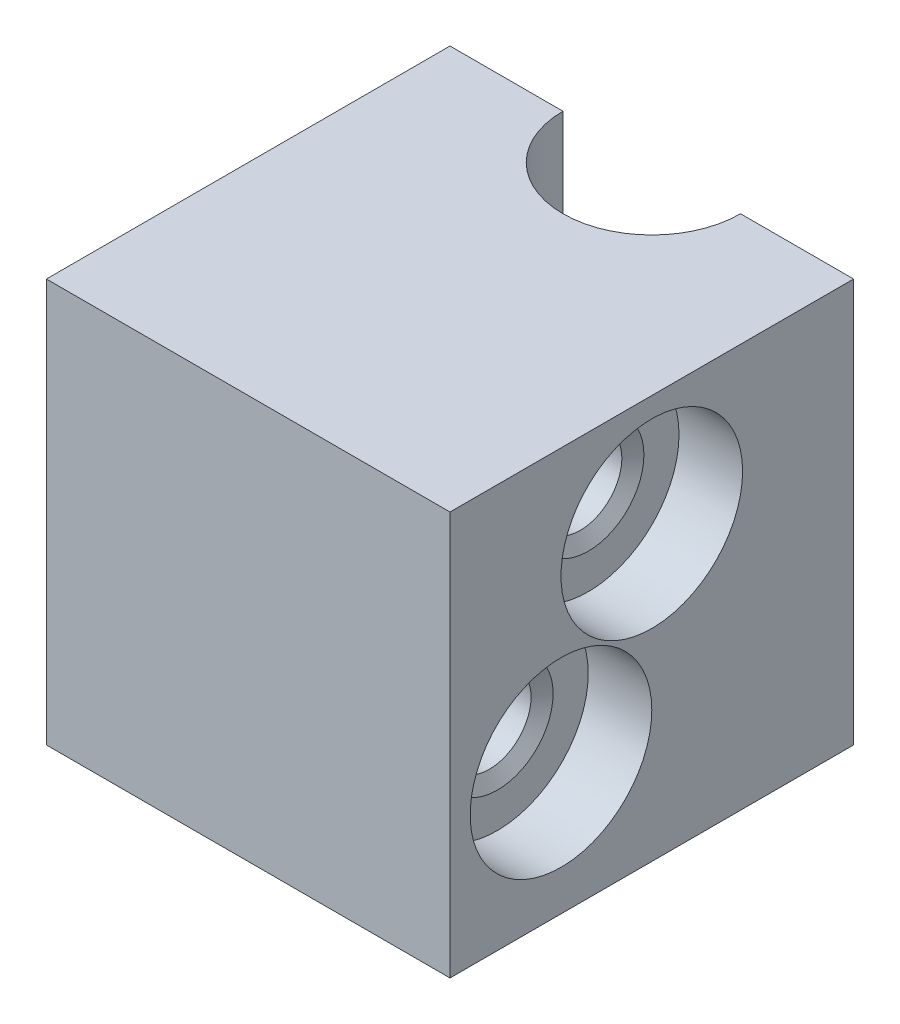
ISO-10303-21;
HEADER;
FILE_DESCRIPTION(('STEP AP214'),'2;1');
FILE_NAME('part.step','',(''),(''),'','','');
FILE_SCHEMA(('AUTOMOTIVE_DESIGN { 1 0 10303 214 1 1 1 1 }'));
ENDSEC;
DATA;
#1=APPLICATION_CONTEXT('core data for automotive mechanical design processes');
#2=APPLICATION_PROTOCOL_DEFINITION('international standard','automotive_design',2000,#1);
#3=PRODUCT_CONTEXT('',#1,'mechanical');
#4=PRODUCT('Part','Part','',(#3));
#5=PRODUCT_RELATED_PRODUCT_CATEGORY('part','',(#4));
#6=PRODUCT_DEFINITION_FORMATION('','',#4);
#7=PRODUCT_DEFINITION_CONTEXT('part definition',#1,'design');
#8=PRODUCT_DEFINITION('design','',#6,#7);
#9=PRODUCT_DEFINITION_SHAPE('','',#8);
#10=(LENGTH_UNIT() NAMED_UNIT(*) SI_UNIT(.MILLI.,.METRE.));
#11=(NAMED_UNIT(*) PLANE_ANGLE_UNIT() SI_UNIT($,.RADIAN.));
#12=(NAMED_UNIT(*) SI_UNIT($,.STERADIAN.) SOLID_ANGLE_UNIT());
#13=UNCERTAINTY_MEASURE_WITH_UNIT(LENGTH_MEASURE(1.E-05),#10,'distance_accuracy_value','');
#14=(GEOMETRIC_REPRESENTATION_CONTEXT(3) GLOBAL_UNCERTAINTY_ASSIGNED_CONTEXT((#13)) GLOBAL_UNIT_ASSIGNED_CONTEXT((#10,
#11,#12)) REPRESENTATION_CONTEXT('',''));
#15=CARTESIAN_POINT('',(0.,0.,0.));
#16=DIRECTION('',(0.,0.,1.));
#17=DIRECTION('',(1.,0.,0.));
#18=AXIS2_PLACEMENT_3D('',#15,#16,#17);
#19=CARTESIAN_POINT('',(50.8,36.83,25.4));
#20=DIRECTION('',(1.,0.,0.));
#21=DIRECTION('',(0.,0.,-1.));
#22=AXIS2_PLACEMENT_3D('',#19,#20,#21);
#23=CYLINDRICAL_SURFACE('',#22,5.24999999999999);
#24=CARTESIAN_POINT('',(9.017,36.83,25.4));
#25=DIRECTION('',(-1.,0.,0.));
#26=DIRECTION('',(0.,0.,1.));
#27=AXIS2_PLACEMENT_3D('',#24,#25,#26);
#28=CIRCLE('',#27,5.24999999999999);
#29=CARTESIAN_POINT('',(9.017,36.83,30.65));
#30=VERTEX_POINT('',#29);
#31=EDGE_CURVE('E167',#30,#30,#28,.T.);
#32=ORIENTED_EDGE('',*,*,#31,.T.);
#33=EDGE_LOOP('',(#32));
#34=FACE_BOUND('',#33,.T.);
#35=CARTESIAN_POINT('',(41.783,36.83,25.4));
#36=DIRECTION('',(1.,0.,0.));
#37=DIRECTION('',(0.,0.,-1.));
#38=AXIS2_PLACEMENT_3D('',#35,#36,#37);
#39=CIRCLE('',#38,5.24999999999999);
#40=CARTESIAN_POINT('',(41.783,36.83,20.15));
#41=VERTEX_POINT('',#40);
#42=EDGE_CURVE('E164',#41,#41,#39,.T.);
#43=ORIENTED_EDGE('',*,*,#42,.T.);
#44=EDGE_LOOP('',(#43));
#45=FACE_BOUND('',#44,.T.);
#46=CARTESIAN_POINT('',(25.4,31.6558161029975,24.511));
#47=CARTESIAN_POINT('',(25.4495499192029,31.655815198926,24.5110019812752));
#48=CARTESIAN_POINT('',(25.4991266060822,31.6550966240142,24.5151566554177));
#49=CARTESIAN_POINT('',(25.5968881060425,31.6523027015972,24.5316578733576));
#50=CARTESIAN_POINT('',(25.6450716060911,31.6502261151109,24.5440118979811));
#51=CARTESIAN_POINT('',(25.7386177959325,31.6449579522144,24.5765266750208));
#52=CARTESIAN_POINT('',(25.7839828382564,31.6417673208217,24.5966808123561));
#53=CARTESIAN_POINT('',(25.8706828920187,31.634631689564,24.6442071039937));
#54=CARTESIAN_POINT('',(25.9120183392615,31.6306867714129,24.6715784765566));
#55=CARTESIAN_POINT('',(25.9899109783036,31.6224422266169,24.7330592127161));
#56=CARTESIAN_POINT('',(26.026421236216,31.6181396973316,24.7672276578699));
#57=CARTESIAN_POINT('',(26.0932192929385,31.6096904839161,24.8412049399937));
#58=CARTESIAN_POINT('',(26.1235067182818,31.6055438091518,24.8810141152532));
#59=CARTESIAN_POINT('',(26.1771759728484,31.5978427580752,24.9654474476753));
#60=CARTESIAN_POINT('',(26.2005140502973,31.5942921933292,25.0100997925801));
#61=CARTESIAN_POINT('',(26.2393408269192,31.5882157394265,25.1027612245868));
#62=CARTESIAN_POINT('',(26.2548300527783,31.5856897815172,25.1507700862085));
#63=CARTESIAN_POINT('',(26.2773756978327,31.5819676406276,25.2482966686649));
#64=CARTESIAN_POINT('',(26.2845110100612,31.5807590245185,25.2977956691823));
#65=CARTESIAN_POINT('',(26.290391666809,31.579765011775,25.3973020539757));
#66=CARTESIAN_POINT('',(26.2891375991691,31.5799795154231,25.4473094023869));
#67=CARTESIAN_POINT('',(26.2783364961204,31.5817977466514,25.5458733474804));
#68=CARTESIAN_POINT('',(26.2688743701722,31.5833872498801,25.5944395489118));
#69=CARTESIAN_POINT('',(26.2420595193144,31.5877610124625,25.6892847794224));
#70=CARTESIAN_POINT('',(26.2247065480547,31.5905453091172,25.7355637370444));
#71=CARTESIAN_POINT('',(26.1825186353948,31.5970199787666,25.8247725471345));
#72=CARTESIAN_POINT('',(26.1576488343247,31.6007145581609,25.8676855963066));
#73=CARTESIAN_POINT('',(26.1011587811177,31.6085995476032,25.9487613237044));
#74=CARTESIAN_POINT('',(26.0695379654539,31.6127899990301,25.9869236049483));
#75=CARTESIAN_POINT('',(25.9999729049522,31.6212628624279,26.057916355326));
#76=CARTESIAN_POINT('',(25.9619544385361,31.6255457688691,26.0906740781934));
#77=CARTESIAN_POINT('',(25.8809230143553,31.6336701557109,26.1493573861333));
#78=CARTESIAN_POINT('',(25.8379100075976,31.6375116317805,26.1752829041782));
#79=CARTESIAN_POINT('',(25.7480246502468,31.6443185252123,26.2195809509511));
#80=CARTESIAN_POINT('',(25.7011477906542,31.6472828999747,26.2379445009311));
#81=CARTESIAN_POINT('',(25.6049132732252,31.6519828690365,26.2665161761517));
#82=CARTESIAN_POINT('',(25.5555558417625,31.6537185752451,26.2767250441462));
#83=CARTESIAN_POINT('',(25.4564127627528,31.6557429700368,26.2885946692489));
#84=CARTESIAN_POINT('',(25.4066398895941,31.6560492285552,26.2903592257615));
#85=CARTESIAN_POINT('',(25.3075100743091,31.6552268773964,26.2855669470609));
#86=CARTESIAN_POINT('',(25.2581531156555,31.6540983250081,26.2790104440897));
#87=CARTESIAN_POINT('',(25.1615873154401,31.6505497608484,26.2578507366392));
#88=CARTESIAN_POINT('',(25.1143665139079,31.6481382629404,26.2433005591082));
#89=CARTESIAN_POINT('',(25.023033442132,31.6423026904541,26.2066222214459));
#90=CARTESIAN_POINT('',(24.9789213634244,31.638878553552,26.1844935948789));
#91=CARTESIAN_POINT('',(24.8945965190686,31.6313627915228,26.1330422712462));
#92=CARTESIAN_POINT('',(24.8544248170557,31.6272651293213,26.1036531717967));
#93=CARTESIAN_POINT('',(24.7795459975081,31.618881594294,26.0386060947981));
#94=CARTESIAN_POINT('',(24.7448392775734,31.614595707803,26.0029476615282));
#95=CARTESIAN_POINT('',(24.6814955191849,31.6062629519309,25.9259137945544));
#96=CARTESIAN_POINT('',(24.6529277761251,31.6022191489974,25.8844809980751));
#97=CARTESIAN_POINT('',(24.6031587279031,31.594875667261,25.7973438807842));
#98=CARTESIAN_POINT('',(24.581957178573,31.5915759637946,25.7516397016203));
#99=CARTESIAN_POINT('',(24.5476296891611,31.5861057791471,25.6574612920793));
#100=CARTESIAN_POINT('',(24.5344677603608,31.5839302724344,25.6090004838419));
#101=CARTESIAN_POINT('',(24.5164773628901,31.5809323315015,25.5105163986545));
#102=CARTESIAN_POINT('',(24.5116481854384,31.5801097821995,25.4604932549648));
#103=CARTESIAN_POINT('',(24.5104812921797,31.5799121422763,25.3609727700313));
#104=CARTESIAN_POINT('',(24.5140382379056,31.5805190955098,25.3114766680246));
#105=CARTESIAN_POINT('',(24.5293144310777,31.5830755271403,25.2137977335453));
#106=CARTESIAN_POINT('',(24.5410336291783,31.5850249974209,25.1656148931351));
#107=CARTESIAN_POINT('',(24.5722607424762,31.5900481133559,25.0719723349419));
#108=CARTESIAN_POINT('',(24.5917594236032,31.5931204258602,25.0265094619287));
#109=CARTESIAN_POINT('',(24.6379801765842,31.6000541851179,24.9394843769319));
#110=CARTESIAN_POINT('',(24.6647026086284,31.6039156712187,24.8979223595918));
#111=CARTESIAN_POINT('',(24.7249844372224,31.6120573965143,24.8193488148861));
#112=CARTESIAN_POINT('',(24.7586208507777,31.6163420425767,24.7823968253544));
#113=CARTESIAN_POINT('',(24.8316143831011,31.6248170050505,24.7146245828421));
#114=CARTESIAN_POINT('',(24.870972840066,31.6290072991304,24.6838057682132));
#115=CARTESIAN_POINT('',(24.9546361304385,31.636852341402,24.6289665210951));
#116=CARTESIAN_POINT('',(24.9989751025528,31.6405029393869,24.604997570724));
#117=CARTESIAN_POINT('',(25.0910942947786,31.6468061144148,24.5648850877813));
#118=CARTESIAN_POINT('',(25.1388710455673,31.6494596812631,24.5487337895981));
#119=CARTESIAN_POINT('',(25.2223572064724,31.6528840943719,24.5281956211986));
#120=CARTESIAN_POINT('',(25.2575630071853,31.6539774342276,24.5217576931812));
#121=CARTESIAN_POINT('',(25.3285078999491,31.6554437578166,24.5131592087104));
#122=CARTESIAN_POINT('',(25.3642469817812,31.6558167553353,24.5109985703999));
#123=CARTESIAN_POINT('',(25.4,31.6558161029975,24.511));
#124=B_SPLINE_CURVE_WITH_KNOTS('',3,(#46,#47,#48,#49,#50,#51,#52,#53,#54,#55,#56,#57,#58,#59,
#60,#61,#62,#63,#64,#65,#66,#67,#68,#69,#70,#71,#72,#73,#74,#75,#76,#77,#78,#79,#80,#81,#82,#83,
#84,#85,#86,#87,#88,#89,#90,#91,#92,#93,#94,#95,#96,#97,#98,#99,#100,#101,#102,#103,#104,#105,
#106,#107,#108,#109,#110,#111,#112,#113,#114,#115,#116,#117,#118,#119,#120,#121,#122,#123),
.UNSPECIFIED.,.T.,.F.,(4,2,2,2,2,2,2,2,2,2,2,2,2,2,2,2,2,2,2,2,2,2,2,2,2,2,2,2,2,2,2,2,2,2,2,2,
2,2,4),(0.,0.148519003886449,0.297173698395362,0.445702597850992,0.594215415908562,
0.744080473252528,0.893954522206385,1.04475311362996,1.19554158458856,1.34489424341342,
1.49423643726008,1.6420519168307,1.78987201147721,1.9383884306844,2.08691725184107,
2.23730589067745,2.38769600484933,2.53826417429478,2.68881862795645,2.83751759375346,
2.9862106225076,3.13392898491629,3.28165644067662,3.43078852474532,3.57993145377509,
3.73067844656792,3.88142044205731,4.03148261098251,4.18153201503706,4.32970670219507,
4.47788049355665,4.62587892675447,4.77388474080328,4.92363849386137,5.07342732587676,
5.22431398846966,5.37505045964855,5.48221721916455,5.58938192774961),.UNSPECIFIED.);
#125=CARTESIAN_POINT('',(25.4,31.6558161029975,24.511));
#126=VERTEX_POINT('',#125);
#127=EDGE_CURVE('E285',#126,#126,#124,.T.);
#128=ORIENTED_EDGE('',*,*,#127,.T.);
#129=EDGE_LOOP('',(#128));
#130=FACE_BOUND('',#129,.T.);
#131=ADVANCED_FACE('F62',(#34,#45,#130),#23,.F.);
#132=CARTESIAN_POINT('',(50.8,16.51,36.83));
#133=DIRECTION('',(1.,0.,0.));
#134=DIRECTION('',(0.,0.,-1.));
#135=AXIS2_PLACEMENT_3D('',#132,#133,#134);
#136=CYLINDRICAL_SURFACE('',#135,5.24999999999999);
#137=CARTESIAN_POINT('',(9.017,16.51,36.83));
#138=DIRECTION('',(-1.,0.,0.));
#139=DIRECTION('',(0.,0.,1.));
#140=AXIS2_PLACEMENT_3D('',#137,#138,#139);
#141=CIRCLE('',#140,5.24999999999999);
#142=CARTESIAN_POINT('',(9.017,16.51,42.08));
#143=VERTEX_POINT('',#142);
#144=EDGE_CURVE('E176',#143,#143,#141,.T.);
#145=ORIENTED_EDGE('',*,*,#144,.T.);
#146=EDGE_LOOP('',(#145));
#147=FACE_BOUND('',#146,.T.);
#148=CARTESIAN_POINT('',(41.783,16.51,36.83));
#149=DIRECTION('',(1.,0.,0.));
#150=DIRECTION('',(0.,0.,-1.));
#151=AXIS2_PLACEMENT_3D('',#148,#149,#150);
#152=CIRCLE('',#151,5.24999999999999);
#153=CARTESIAN_POINT('',(41.783,16.51,31.58));
#154=VERTEX_POINT('',#153);
#155=EDGE_CURVE('E173',#154,#154,#152,.T.);
#156=ORIENTED_EDGE('',*,*,#155,.T.);
#157=EDGE_LOOP('',(#156));
#158=FACE_BOUND('',#157,.T.);
#159=CARTESIAN_POINT('',(25.4,11.3358161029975,35.941));
#160=CARTESIAN_POINT('',(25.4495499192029,11.335815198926,35.9410019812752));
#161=CARTESIAN_POINT('',(25.4991266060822,11.3350966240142,35.9451566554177));
#162=CARTESIAN_POINT('',(25.5968881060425,11.3323027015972,35.9616578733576));
#163=CARTESIAN_POINT('',(25.6450716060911,11.3302261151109,35.9740118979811));
#164=CARTESIAN_POINT('',(25.7386177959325,11.3249579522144,36.0065266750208));
#165=CARTESIAN_POINT('',(25.7839828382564,11.3217673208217,36.026680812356));
#166=CARTESIAN_POINT('',(25.8706828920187,11.314631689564,36.0742071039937));
#167=CARTESIAN_POINT('',(25.9120183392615,11.3106867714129,36.1015784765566));
#168=CARTESIAN_POINT('',(25.9899109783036,11.3024422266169,36.1630592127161));
#169=CARTESIAN_POINT('',(26.026421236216,11.2981396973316,36.1972276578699));
#170=CARTESIAN_POINT('',(26.0932192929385,11.2896904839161,36.2712049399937));
#171=CARTESIAN_POINT('',(26.1235067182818,11.2855438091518,36.3110141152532));
#172=CARTESIAN_POINT('',(26.1771759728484,11.2778427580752,36.3954474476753));
#173=CARTESIAN_POINT('',(26.2005140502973,11.2742921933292,36.44009979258));
#174=CARTESIAN_POINT('',(26.2393408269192,11.2682157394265,36.5327612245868));
#175=CARTESIAN_POINT('',(26.2548300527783,11.2656897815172,36.5807700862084));
#176=CARTESIAN_POINT('',(26.2773756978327,11.2619676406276,36.6782966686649));
#177=CARTESIAN_POINT('',(26.2845110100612,11.2607590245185,36.7277956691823));
#178=CARTESIAN_POINT('',(26.290391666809,11.259765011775,36.8273020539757));
#179=CARTESIAN_POINT('',(26.2891375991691,11.2599795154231,36.8773094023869));
#180=CARTESIAN_POINT('',(26.2783364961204,11.2617977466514,36.9758733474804));
#181=CARTESIAN_POINT('',(26.2688743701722,11.2633872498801,37.0244395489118));
#182=CARTESIAN_POINT('',(26.2420595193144,11.2677610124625,37.1192847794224));
#183=CARTESIAN_POINT('',(26.2247065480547,11.2705453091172,37.1655637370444));
#184=CARTESIAN_POINT('',(26.1825186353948,11.2770199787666,37.2547725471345));
#185=CARTESIAN_POINT('',(26.1576488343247,11.2807145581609,37.2976855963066));
#186=CARTESIAN_POINT('',(26.1011587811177,11.2885995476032,37.3787613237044));
#187=CARTESIAN_POINT('',(26.0695379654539,11.2927899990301,37.4169236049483));
#188=CARTESIAN_POINT('',(25.9999729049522,11.3012628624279,37.487916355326));
#189=CARTESIAN_POINT('',(25.9619544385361,11.3055457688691,37.5206740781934));
#190=CARTESIAN_POINT('',(25.8809230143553,11.3136701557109,37.5793573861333));
#191=CARTESIAN_POINT('',(25.8379100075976,11.3175116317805,37.6052829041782));
#192=CARTESIAN_POINT('',(25.7480246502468,11.3243185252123,37.6495809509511));
#193=CARTESIAN_POINT('',(25.7011477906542,11.3272828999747,37.6679445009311));
#194=CARTESIAN_POINT('',(25.6049132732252,11.3319828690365,37.6965161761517));
#195=CARTESIAN_POINT('',(25.5555558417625,11.3337185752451,37.7067250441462));
#196=CARTESIAN_POINT('',(25.4564127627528,11.3357429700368,37.7185946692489));
#197=CARTESIAN_POINT('',(25.4066398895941,11.3360492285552,37.7203592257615));
#198=CARTESIAN_POINT('',(25.3075100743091,11.3352268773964,37.7155669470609));
#199=CARTESIAN_POINT('',(25.2581531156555,11.3340983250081,37.7090104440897));
#200=CARTESIAN_POINT('',(25.1615873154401,11.3305497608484,37.6878507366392));
#201=CARTESIAN_POINT('',(25.1143665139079,11.3281382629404,37.6733005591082));
#202=CARTESIAN_POINT('',(25.023033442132,11.3223026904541,37.6366222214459));
#203=CARTESIAN_POINT('',(24.9789213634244,11.318878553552,37.6144935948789));
#204=CARTESIAN_POINT('',(24.8945965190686,11.3113627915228,37.5630422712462));
#205=CARTESIAN_POINT('',(24.8544248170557,11.3072651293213,37.5336531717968));
#206=CARTESIAN_POINT('',(24.7795459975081,11.298881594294,37.4686060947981));
#207=CARTESIAN_POINT('',(24.7448392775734,11.294595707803,37.4329476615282));
#208=CARTESIAN_POINT('',(24.6814955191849,11.2862629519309,37.3559137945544));
#209=CARTESIAN_POINT('',(24.6529277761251,11.2822191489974,37.3144809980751));
#210=CARTESIAN_POINT('',(24.6031587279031,11.274875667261,37.2273438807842));
#211=CARTESIAN_POINT('',(24.581957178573,11.2715759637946,37.1816397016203));
#212=CARTESIAN_POINT('',(24.5476296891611,11.2661057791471,37.0874612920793));
#213=CARTESIAN_POINT('',(24.5344677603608,11.2639302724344,37.0390004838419));
#214=CARTESIAN_POINT('',(24.5164773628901,11.2609323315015,36.9405163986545));
#215=CARTESIAN_POINT('',(24.5116481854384,11.2601097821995,36.8904932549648));
#216=CARTESIAN_POINT('',(24.5104812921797,11.2599121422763,36.7909727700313));
#217=CARTESIAN_POINT('',(24.5140382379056,11.2605190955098,36.7414766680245));
#218=CARTESIAN_POINT('',(24.5293144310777,11.2630755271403,36.6437977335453));
#219=CARTESIAN_POINT('',(24.5410336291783,11.2650249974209,36.5956148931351));
#220=CARTESIAN_POINT('',(24.5722607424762,11.2700481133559,36.5019723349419));
#221=CARTESIAN_POINT('',(24.5917594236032,11.2731204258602,36.4565094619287));
#222=CARTESIAN_POINT('',(24.6379801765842,11.2800541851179,36.3694843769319));
#223=CARTESIAN_POINT('',(24.6647026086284,11.2839156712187,36.3279223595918));
#224=CARTESIAN_POINT('',(24.7249844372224,11.2920573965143,36.2493488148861));
#225=CARTESIAN_POINT('',(24.7586208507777,11.2963420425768,36.2123968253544));
#226=CARTESIAN_POINT('',(24.8316143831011,11.3048170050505,36.1446245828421));
#227=CARTESIAN_POINT('',(24.870972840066,11.3090072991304,36.1138057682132));
#228=CARTESIAN_POINT('',(24.9546361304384,11.316852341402,36.058966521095));
#229=CARTESIAN_POINT('',(24.9989751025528,11.3205029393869,36.034997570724));
#230=CARTESIAN_POINT('',(25.0910942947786,11.3268061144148,35.9948850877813));
#231=CARTESIAN_POINT('',(25.1388710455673,11.3294596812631,35.9787337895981));
#232=CARTESIAN_POINT('',(25.2223572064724,11.3328840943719,35.9581956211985));
#233=CARTESIAN_POINT('',(25.2575630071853,11.3339774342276,35.9517576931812));
#234=CARTESIAN_POINT('',(25.3285078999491,11.3354437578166,35.9431592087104));
#235=CARTESIAN_POINT('',(25.3642469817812,11.3358167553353,35.9409985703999));
#236=CARTESIAN_POINT('',(25.4,11.3358161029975,35.941));
#237=B_SPLINE_CURVE_WITH_KNOTS('',3,(#159,#160,#161,#162,#163,#164,#165,#166,#167,#168,#169,
#170,#171,#172,#173,#174,#175,#176,#177,#178,#179,#180,#181,#182,#183,#184,#185,#186,#187,#188,
#189,#190,#191,#192,#193,#194,#195,#196,#197,#198,#199,#200,#201,#202,#203,#204,#205,#206,#207,
#208,#209,#210,#211,#212,#213,#214,#215,#216,#217,#218,#219,#220,#221,#222,#223,#224,#225,#226,
#227,#228,#229,#230,#231,#232,#233,#234,#235,#236),.UNSPECIFIED.,.T.,.F.,(4,2,2,2,2,2,2,2,2,2,2,
2,2,2,2,2,2,2,2,2,2,2,2,2,2,2,2,2,2,2,2,2,2,2,2,2,2,2,4),(0.,0.148519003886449,
0.297173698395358,0.44570259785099,0.594215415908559,0.74408047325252,0.893954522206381,
1.04475311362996,1.19554158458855,1.34489424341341,1.49423643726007,1.64205191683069,
1.78987201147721,1.9383884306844,2.08691725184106,2.23730589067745,2.38769600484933,
2.53826417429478,2.68881862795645,2.83751759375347,2.9862106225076,3.13392898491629,
3.28165644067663,3.43078852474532,3.5799314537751,3.73067844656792,3.88142044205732,
4.03148261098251,4.18153201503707,4.32970670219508,4.47788049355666,4.62587892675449,
4.77388474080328,4.92363849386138,5.07342732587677,5.22431398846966,5.37505045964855,
5.48221721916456,5.58938192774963),.UNSPECIFIED.);
#238=CARTESIAN_POINT('',(25.4,11.3358161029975,35.941));
#239=VERTEX_POINT('',#238);
#240=EDGE_CURVE('E405',#239,#239,#237,.T.);
#241=ORIENTED_EDGE('',*,*,#240,.T.);
#242=EDGE_LOOP('',(#241));
#243=FACE_BOUND('',#242,.T.);
#244=ADVANCED_FACE('F198',(#147,#158,#243),#136,.F.);
#245=CARTESIAN_POINT('',(50.8,0.,50.8));
#246=DIRECTION('',(-1.,0.,0.));
#247=DIRECTION('',(0.,0.,1.));
#248=AXIS2_PLACEMENT_3D('',#245,#246,#247);
#249=PLANE('',#248);
#250=CARTESIAN_POINT('',(50.8,36.83,25.4));
#251=DIRECTION('',(1.,0.,0.));
#252=DIRECTION('',(0.,0.,-1.));
#253=AXIS2_PLACEMENT_3D('',#250,#251,#252);
#254=CIRCLE('',#253,11.43);
#255=CARTESIAN_POINT('',(50.8,36.83,13.97));
#256=VERTEX_POINT('',#255);
#257=EDGE_CURVE('E269',#256,#256,#254,.T.);
#258=ORIENTED_EDGE('',*,*,#257,.F.);
#259=EDGE_LOOP('',(#258));
#260=FACE_BOUND('',#259,.T.);
#261=CARTESIAN_POINT('',(50.8,16.51,36.83));
#262=DIRECTION('',(1.,0.,0.));
#263=DIRECTION('',(0.,0.,-1.));
#264=AXIS2_PLACEMENT_3D('',#261,#262,#263);
#265=CIRCLE('',#264,11.4300000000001);
#266=CARTESIAN_POINT('',(50.8,16.51,25.3999999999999));
#267=VERTEX_POINT('',#266);
#268=EDGE_CURVE('E274',#267,#267,#265,.T.);
#269=ORIENTED_EDGE('',*,*,#268,.F.);
#270=EDGE_LOOP('',(#269));
#271=FACE_BOUND('',#270,.T.);
#272=DIRECTION('',(0.,1.,0.));
#273=VECTOR('',#272,1.);
#274=CARTESIAN_POINT('',(50.8,0.,0.));
#275=LINE('',#274,#273);
#276=CARTESIAN_POINT('',(50.8,0.,0.));
#277=VERTEX_POINT('',#276);
#278=CARTESIAN_POINT('',(50.8,50.8,0.));
#279=VERTEX_POINT('',#278);
#280=EDGE_CURVE('E141',#277,#279,#275,.T.);
#281=ORIENTED_EDGE('',*,*,#280,.T.);
#282=DIRECTION('',(0.,0.,-1.));
#283=VECTOR('',#282,1.);
#284=CARTESIAN_POINT('',(50.8,50.8,50.8));
#285=LINE('',#284,#283);
#286=CARTESIAN_POINT('',(50.8,50.8,50.8));
#287=VERTEX_POINT('',#286);
#288=EDGE_CURVE('E154',#287,#279,#285,.T.);
#289=ORIENTED_EDGE('',*,*,#288,.F.);
#290=DIRECTION('',(0.,1.,0.));
#291=VECTOR('',#290,1.);
#292=CARTESIAN_POINT('',(50.8,0.,50.8));
#293=LINE('',#292,#291);
#294=CARTESIAN_POINT('',(50.8,0.,50.8));
#295=VERTEX_POINT('',#294);
#296=EDGE_CURVE('E388',#295,#287,#293,.T.);
#297=ORIENTED_EDGE('',*,*,#296,.F.);
#298=DIRECTION('',(0.,0.,-1.));
#299=VECTOR('',#298,1.);
#300=CARTESIAN_POINT('',(50.8,0.,50.8));
#301=LINE('',#300,#299);
#302=EDGE_CURVE('E157',#295,#277,#301,.T.);
#303=ORIENTED_EDGE('',*,*,#302,.T.);
#304=EDGE_LOOP('',(#281,#289,#297,#303));
#305=FACE_BOUND('',#304,.T.);
#306=ADVANCED_FACE('F204',(#260,#271,#305),#249,.F.);
#307=CARTESIAN_POINT('',(0.,0.,0.));
#308=DIRECTION('',(0.,0.,-1.));
#309=DIRECTION('',(-1.,0.,0.));
#310=AXIS2_PLACEMENT_3D('',#307,#308,#309);
#311=PLANE('',#310);
#312=CARTESIAN_POINT('',(6.35,9.4488,0.));
#313=DIRECTION('',(0.,0.,-1.));
#314=DIRECTION('',(-1.,0.,0.));
#315=AXIS2_PLACEMENT_3D('',#312,#313,#314);
#316=CIRCLE('',#315,2.55269999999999);
#317=CARTESIAN_POINT('',(3.79730000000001,9.4488,0.));
#318=VERTEX_POINT('',#317);
#319=EDGE_CURVE('E357',#318,#318,#316,.T.);
#320=ORIENTED_EDGE('',*,*,#319,.F.);
#321=EDGE_LOOP('',(#320));
#322=FACE_BOUND('',#321,.T.);
#323=CARTESIAN_POINT('',(6.35,41.1988,0.));
#324=DIRECTION('',(0.,0.,-1.));
#325=DIRECTION('',(-1.,0.,0.));
#326=AXIS2_PLACEMENT_3D('',#323,#324,#325);
#327=CIRCLE('',#326,2.55269999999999);
#328=CARTESIAN_POINT('',(3.79730000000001,41.1988,0.));
#329=VERTEX_POINT('',#328);
#330=EDGE_CURVE('E372',#329,#329,#327,.T.);
#331=ORIENTED_EDGE('',*,*,#330,.F.);
#332=EDGE_LOOP('',(#331));
#333=FACE_BOUND('',#332,.T.);
#334=DIRECTION('',(0.,1.,0.));
#335=VECTOR('',#334,1.);
#336=CARTESIAN_POINT('',(14.224,-0.001000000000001,0.));
#337=LINE('',#336,#335);
#338=CARTESIAN_POINT('',(14.224,0.,0.));
#339=VERTEX_POINT('',#338);
#340=CARTESIAN_POINT('',(14.224,50.8,0.));
#341=VERTEX_POINT('',#340);
#342=EDGE_CURVE('E130',#339,#341,#337,.T.);
#343=ORIENTED_EDGE('',*,*,#342,.F.);
#344=DIRECTION('',(1.,0.,0.));
#345=VECTOR('',#344,1.);
#346=CARTESIAN_POINT('',(0.,0.,0.));
#347=LINE('',#346,#345);
#348=CARTESIAN_POINT('',(0.,0.,0.));
#349=VERTEX_POINT('',#348);
#350=EDGE_CURVE('E136',#349,#339,#347,.T.);
#351=ORIENTED_EDGE('',*,*,#350,.F.);
#352=DIRECTION('',(0.,-1.,0.));
#353=VECTOR('',#352,1.);
#354=CARTESIAN_POINT('',(0.,0.,0.));
#355=LINE('',#354,#353);
#356=CARTESIAN_POINT('',(0.,50.8,0.));
#357=VERTEX_POINT('',#356);
#358=EDGE_CURVE('E142',#357,#349,#355,.T.);
#359=ORIENTED_EDGE('',*,*,#358,.F.);
#360=DIRECTION('',(-1.,0.,0.));
#361=VECTOR('',#360,1.);
#362=CARTESIAN_POINT('',(0.,50.8,0.));
#363=LINE('',#362,#361);
#364=EDGE_CURVE('E106',#341,#357,#363,.T.);
#365=ORIENTED_EDGE('',*,*,#364,.F.);
#366=EDGE_LOOP('',(#343,#351,#359,#365));
#367=FACE_BOUND('',#366,.T.);
#368=ADVANCED_FACE('F220',(#322,#333,#367),#311,.T.);
#369=CARTESIAN_POINT('',(0.,0.,50.8));
#370=DIRECTION('',(1.,0.,0.));
#371=DIRECTION('',(0.,0.,-1.));
#372=AXIS2_PLACEMENT_3D('',#369,#370,#371);
#373=PLANE('',#372);
#374=CARTESIAN_POINT('',(0.,36.83,25.4));
#375=DIRECTION('',(1.,0.,0.));
#376=DIRECTION('',(0.,0.,-1.));
#377=AXIS2_PLACEMENT_3D('',#374,#375,#376);
#378=CIRCLE('',#377,11.43);
#379=CARTESIAN_POINT('',(0.,36.83,13.97));
#380=VERTEX_POINT('',#379);
#381=EDGE_CURVE('E257',#380,#380,#378,.T.);
#382=ORIENTED_EDGE('',*,*,#381,.T.);
#383=EDGE_LOOP('',(#382));
#384=FACE_BOUND('',#383,.T.);
#385=CARTESIAN_POINT('',(0.,16.51,36.83));
#386=DIRECTION('',(1.,0.,0.));
#387=DIRECTION('',(0.,0.,-1.));
#388=AXIS2_PLACEMENT_3D('',#385,#386,#387);
#389=CIRCLE('',#388,11.4300000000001);
#390=CARTESIAN_POINT('',(0.,16.51,25.3999999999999));
#391=VERTEX_POINT('',#390);
#392=EDGE_CURVE('E256',#391,#391,#389,.T.);
#393=ORIENTED_EDGE('',*,*,#392,.T.);
#394=EDGE_LOOP('',(#393));
#395=FACE_BOUND('',#394,.T.);
#396=ORIENTED_EDGE('',*,*,#358,.T.);
#397=DIRECTION('',(0.,0.,-1.));
#398=VECTOR('',#397,1.);
#399=CARTESIAN_POINT('',(0.,0.,50.8));
#400=LINE('',#399,#398);
#401=CARTESIAN_POINT('',(0.,0.,50.8));
#402=VERTEX_POINT('',#401);
#403=EDGE_CURVE('E159',#402,#349,#400,.T.);
#404=ORIENTED_EDGE('',*,*,#403,.F.);
#405=DIRECTION('',(0.,-1.,0.));
#406=VECTOR('',#405,1.);
#407=CARTESIAN_POINT('',(0.,0.,50.8));
#408=LINE('',#407,#406);
#409=CARTESIAN_POINT('',(0.,50.8,50.8));
#410=VERTEX_POINT('',#409);
#411=EDGE_CURVE('E151',#410,#402,#408,.T.);
#412=ORIENTED_EDGE('',*,*,#411,.F.);
#413=DIRECTION('',(0.,0.,-1.));
#414=VECTOR('',#413,1.);
#415=CARTESIAN_POINT('',(0.,50.8,50.8));
#416=LINE('',#415,#414);
#417=EDGE_CURVE('E152',#410,#357,#416,.T.);
#418=ORIENTED_EDGE('',*,*,#417,.T.);
#419=EDGE_LOOP('',(#396,#404,#412,#418));
#420=FACE_BOUND('',#419,.T.);
#421=ADVANCED_FACE('F228',(#384,#395,#420),#373,.F.);
#422=CARTESIAN_POINT('',(0.,0.,50.8));
#423=DIRECTION('',(0.,1.,0.));
#424=DIRECTION('',(0.,0.,1.));
#425=AXIS2_PLACEMENT_3D('',#422,#423,#424);
#426=PLANE('',#425);
#427=CARTESIAN_POINT('',(25.4,0.,36.83));
#428=DIRECTION('',(0.,-1.,0.));
#429=DIRECTION('',(0.,0.,-1.));
#430=AXIS2_PLACEMENT_3D('',#427,#428,#429);
#431=CIRCLE('',#430,2.54);
#432=CARTESIAN_POINT('',(25.4,0.,34.29));
#433=VERTEX_POINT('',#432);
#434=EDGE_CURVE('E402',#433,#433,#431,.T.);
#435=ORIENTED_EDGE('',*,*,#434,.F.);
#436=EDGE_LOOP('',(#435));
#437=FACE_BOUND('',#436,.T.);
#438=CARTESIAN_POINT('',(25.4,0.,25.4));
#439=DIRECTION('',(0.,-1.,0.));
#440=DIRECTION('',(0.,0.,-1.));
#441=AXIS2_PLACEMENT_3D('',#438,#439,#440);
#442=CIRCLE('',#441,2.54);
#443=CARTESIAN_POINT('',(25.4,0.,22.86));
#444=VERTEX_POINT('',#443);
#445=EDGE_CURVE('E396',#444,#444,#442,.T.);
#446=ORIENTED_EDGE('',*,*,#445,.F.);
#447=EDGE_LOOP('',(#446));
#448=FACE_BOUND('',#447,.T.);
#449=ORIENTED_EDGE('',*,*,#350,.T.);
#450=CARTESIAN_POINT('',(25.4,0.,0.));
#451=DIRECTION('',(0.,1.,0.));
#452=DIRECTION('',(0.,0.,1.));
#453=AXIS2_PLACEMENT_3D('',#450,#451,#452);
#454=CIRCLE('',#453,11.176);
#455=CARTESIAN_POINT('',(36.576,0.,0.));
#456=VERTEX_POINT('',#455);
#457=EDGE_CURVE('E124',#456,#339,#454,.F.);
#458=ORIENTED_EDGE('',*,*,#457,.F.);
#459=EDGE_CURVE('E134',#456,#277,#347,.T.);
#460=ORIENTED_EDGE('',*,*,#459,.T.);
#461=ORIENTED_EDGE('',*,*,#302,.F.);
#462=DIRECTION('',(1.,0.,0.));
#463=VECTOR('',#462,1.);
#464=CARTESIAN_POINT('',(0.,0.,50.8));
#465=LINE('',#464,#463);
#466=EDGE_CURVE('E114',#402,#295,#465,.T.);
#467=ORIENTED_EDGE('',*,*,#466,.F.);
#468=ORIENTED_EDGE('',*,*,#403,.T.);
#469=EDGE_LOOP('',(#449,#458,#460,#461,#467,#468));
#470=FACE_BOUND('',#469,.T.);
#471=ADVANCED_FACE('F133',(#437,#448,#470),#426,.F.);
#472=CARTESIAN_POINT('',(0.,50.8,50.8));
#473=DIRECTION('',(0.,-1.,0.));
#474=DIRECTION('',(0.,0.,-1.));
#475=AXIS2_PLACEMENT_3D('',#472,#473,#474);
#476=PLANE('',#475);
#477=CARTESIAN_POINT('',(36.576,50.8,0.));
#478=VERTEX_POINT('',#477);
#479=EDGE_CURVE('E149',#279,#478,#363,.T.);
#480=ORIENTED_EDGE('',*,*,#479,.T.);
#481=CARTESIAN_POINT('',(25.4,50.8,0.));
#482=DIRECTION('',(0.,1.,0.));
#483=DIRECTION('',(0.,0.,1.));
#484=AXIS2_PLACEMENT_3D('',#481,#482,#483);
#485=CIRCLE('',#484,11.176);
#486=EDGE_CURVE('E77',#341,#478,#485,.T.);
#487=ORIENTED_EDGE('',*,*,#486,.F.);
#488=ORIENTED_EDGE('',*,*,#364,.T.);
#489=ORIENTED_EDGE('',*,*,#417,.F.);
#490=DIRECTION('',(-1.,0.,0.));
#491=VECTOR('',#490,1.);
#492=CARTESIAN_POINT('',(0.,50.8,50.8));
#493=LINE('',#492,#491);
#494=EDGE_CURVE('E86',#287,#410,#493,.T.);
#495=ORIENTED_EDGE('',*,*,#494,.F.);
#496=ORIENTED_EDGE('',*,*,#288,.T.);
#497=EDGE_LOOP('',(#480,#487,#488,#489,#495,#496));
#498=FACE_BOUND('',#497,.T.);
#499=ADVANCED_FACE('F216',(#498),#476,.F.);
#500=CARTESIAN_POINT('',(0.,0.,50.8));
#501=DIRECTION('',(0.,0.,-1.));
#502=DIRECTION('',(-1.,0.,0.));
#503=AXIS2_PLACEMENT_3D('',#500,#501,#502);
#504=PLANE('',#503);
#505=ORIENTED_EDGE('',*,*,#411,.T.);
#506=ORIENTED_EDGE('',*,*,#466,.T.);
#507=ORIENTED_EDGE('',*,*,#296,.T.);
#508=ORIENTED_EDGE('',*,*,#494,.T.);
#509=EDGE_LOOP('',(#505,#506,#507,#508));
#510=FACE_BOUND('',#509,.T.);
#511=ADVANCED_FACE('F213',(#510),#504,.F.);
#512=CARTESIAN_POINT('',(44.45,9.4488,0.));
#513=DIRECTION('',(0.,0.,-1.));
#514=DIRECTION('',(-1.,0.,0.));
#515=AXIS2_PLACEMENT_3D('',#512,#513,#514);
#516=CIRCLE('',#515,2.55269999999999);
#517=CARTESIAN_POINT('',(41.8973,9.4488,0.));
#518=VERTEX_POINT('',#517);
#519=EDGE_CURVE('E356',#518,#518,#516,.T.);
#520=ORIENTED_EDGE('',*,*,#519,.F.);
#521=EDGE_LOOP('',(#520));
#522=FACE_BOUND('',#521,.T.);
#523=CARTESIAN_POINT('',(44.45,41.1988,0.));
#524=DIRECTION('',(0.,0.,-1.));
#525=DIRECTION('',(-1.,0.,0.));
#526=AXIS2_PLACEMENT_3D('',#523,#524,#525);
#527=CIRCLE('',#526,2.55269999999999);
#528=CARTESIAN_POINT('',(41.8973,41.1988,0.));
#529=VERTEX_POINT('',#528);
#530=EDGE_CURVE('E367',#529,#529,#527,.T.);
#531=ORIENTED_EDGE('',*,*,#530,.F.);
#532=EDGE_LOOP('',(#531));
#533=FACE_BOUND('',#532,.T.);
#534=DIRECTION('',(0.,1.,0.));
#535=VECTOR('',#534,1.);
#536=CARTESIAN_POINT('',(36.576,-0.001000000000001,0.));
#537=LINE('',#536,#535);
#538=EDGE_CURVE('E121',#456,#478,#537,.T.);
#539=ORIENTED_EDGE('',*,*,#538,.T.);
#540=ORIENTED_EDGE('',*,*,#479,.F.);
#541=ORIENTED_EDGE('',*,*,#280,.F.);
#542=ORIENTED_EDGE('',*,*,#459,.F.);
#543=EDGE_LOOP('',(#539,#540,#541,#542));
#544=FACE_BOUND('',#543,.T.);
#545=ADVANCED_FACE('F140',(#522,#533,#544),#311,.T.);
#546=CARTESIAN_POINT('',(25.4,-0.001000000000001,0.));
#547=DIRECTION('',(0.,1.,0.));
#548=DIRECTION('',(0.,0.,1.));
#549=AXIS2_PLACEMENT_3D('',#546,#547,#548);
#550=CYLINDRICAL_SURFACE('',#549,11.176);
#551=ORIENTED_EDGE('',*,*,#457,.T.);
#552=ORIENTED_EDGE('',*,*,#342,.T.);
#553=ORIENTED_EDGE('',*,*,#486,.T.);
#554=ORIENTED_EDGE('',*,*,#538,.F.);
#555=EDGE_LOOP('',(#551,#552,#553,#554));
#556=FACE_BOUND('',#555,.T.);
#557=ADVANCED_FACE('F123',(#556),#550,.F.);
#558=CARTESIAN_POINT('',(25.4,8.89,25.4));
#559=DIRECTION('',(0.,-1.,0.));
#560=DIRECTION('',(0.,0.,-1.));
#561=AXIS2_PLACEMENT_3D('',#558,#559,#560);
#562=CYLINDRICAL_SURFACE('',#561,2.54);
#563=CARTESIAN_POINT('',(25.4,8.89,25.4));
#564=DIRECTION('',(0.,-1.,0.));
#565=DIRECTION('',(0.,0.,-1.));
#566=AXIS2_PLACEMENT_3D('',#563,#564,#565);
#567=CIRCLE('',#566,2.54);
#568=CARTESIAN_POINT('',(25.4,8.89,22.86));
#569=VERTEX_POINT('',#568);
#570=EDGE_CURVE('E137',#569,#569,#567,.T.);
#571=ORIENTED_EDGE('',*,*,#570,.F.);
#572=EDGE_LOOP('',(#571));
#573=FACE_BOUND('',#572,.T.);
#574=ORIENTED_EDGE('',*,*,#445,.T.);
#575=EDGE_LOOP('',(#574));
#576=FACE_BOUND('',#575,.T.);
#577=ADVANCED_FACE('F212',(#573,#576),#562,.F.);
#578=CARTESIAN_POINT('',(25.4,8.89,25.4));
#579=DIRECTION('',(0.,-1.,0.));
#580=DIRECTION('',(0.,0.,-1.));
#581=AXIS2_PLACEMENT_3D('',#578,#579,#580);
#582=PLANE('',#581);
#583=CARTESIAN_POINT('',(25.4,8.89,25.4));
#584=DIRECTION('',(0.,-1.,0.));
#585=DIRECTION('',(0.,0.,-1.));
#586=AXIS2_PLACEMENT_3D('',#583,#584,#585);
#587=CIRCLE('',#586,0.888999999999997);
#588=CARTESIAN_POINT('',(25.4,8.89,24.511));
#589=VERTEX_POINT('',#588);
#590=EDGE_CURVE('E280',#589,#589,#587,.T.);
#591=ORIENTED_EDGE('',*,*,#590,.F.);
#592=EDGE_LOOP('',(#591));
#593=FACE_BOUND('',#592,.T.);
#594=ORIENTED_EDGE('',*,*,#570,.T.);
#595=EDGE_LOOP('',(#594));
#596=FACE_BOUND('',#595,.T.);
#597=ADVANCED_FACE('F431',(#593,#596),#582,.T.);
#598=CARTESIAN_POINT('',(25.4,8.89,36.83));
#599=DIRECTION('',(0.,-1.,0.));
#600=DIRECTION('',(0.,0.,-1.));
#601=AXIS2_PLACEMENT_3D('',#598,#599,#600);
#602=CYLINDRICAL_SURFACE('',#601,2.54);
#603=CARTESIAN_POINT('',(25.4,8.89,36.83));
#604=DIRECTION('',(0.,-1.,0.));
#605=DIRECTION('',(0.,0.,-1.));
#606=AXIS2_PLACEMENT_3D('',#603,#604,#605);
#607=CIRCLE('',#606,2.54);
#608=CARTESIAN_POINT('',(25.4,8.89,34.29));
#609=VERTEX_POINT('',#608);
#610=EDGE_CURVE('E399',#609,#609,#607,.T.);
#611=ORIENTED_EDGE('',*,*,#610,.F.);
#612=EDGE_LOOP('',(#611));
#613=FACE_BOUND('',#612,.T.);
#614=ORIENTED_EDGE('',*,*,#434,.T.);
#615=EDGE_LOOP('',(#614));
#616=FACE_BOUND('',#615,.T.);
#617=ADVANCED_FACE('F420',(#613,#616),#602,.F.);
#618=CARTESIAN_POINT('',(25.4,8.89,36.83));
#619=DIRECTION('',(0.,-1.,0.));
#620=DIRECTION('',(0.,0.,-1.));
#621=AXIS2_PLACEMENT_3D('',#618,#619,#620);
#622=PLANE('',#621);
#623=CARTESIAN_POINT('',(25.4,8.89,36.83));
#624=DIRECTION('',(0.,-1.,0.));
#625=DIRECTION('',(0.,0.,-1.));
#626=AXIS2_PLACEMENT_3D('',#623,#624,#625);
#627=CIRCLE('',#626,0.888999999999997);
#628=CARTESIAN_POINT('',(25.4,8.89,35.941));
#629=VERTEX_POINT('',#628);
#630=EDGE_CURVE('E292',#629,#629,#627,.T.);
#631=ORIENTED_EDGE('',*,*,#630,.F.);
#632=EDGE_LOOP('',(#631));
#633=FACE_BOUND('',#632,.T.);
#634=ORIENTED_EDGE('',*,*,#610,.T.);
#635=EDGE_LOOP('',(#634));
#636=FACE_BOUND('',#635,.T.);
#637=ADVANCED_FACE('F415',(#633,#636),#622,.T.);
#638=CARTESIAN_POINT('',(25.4,8.89,36.83));
#639=DIRECTION('',(0.,-1.,0.));
#640=DIRECTION('',(0.,0.,-1.));
#641=AXIS2_PLACEMENT_3D('',#638,#639,#640);
#642=CYLINDRICAL_SURFACE('',#641,0.888999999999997);
#643=ORIENTED_EDGE('',*,*,#240,.F.);
#644=EDGE_LOOP('',(#643));
#645=FACE_BOUND('',#644,.T.);
#646=ORIENTED_EDGE('',*,*,#630,.T.);
#647=EDGE_LOOP('',(#646));
#648=FACE_BOUND('',#647,.T.);
#649=ADVANCED_FACE('F301',(#645,#648),#642,.F.);
#650=CARTESIAN_POINT('',(25.4,8.89,25.4));
#651=DIRECTION('',(0.,-1.,0.));
#652=DIRECTION('',(0.,0.,-1.));
#653=AXIS2_PLACEMENT_3D('',#650,#651,#652);
#654=CYLINDRICAL_SURFACE('',#653,0.888999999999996);
#655=ORIENTED_EDGE('',*,*,#127,.F.);
#656=EDGE_LOOP('',(#655));
#657=FACE_BOUND('',#656,.T.);
#658=ORIENTED_EDGE('',*,*,#590,.T.);
#659=EDGE_LOOP('',(#658));
#660=FACE_BOUND('',#659,.T.);
#661=ADVANCED_FACE('F296',(#657,#660),#654,.F.);
#662=CARTESIAN_POINT('',(42.799,16.51,36.83));
#663=DIRECTION('',(1.,0.,0.));
#664=DIRECTION('',(0.,0.,-1.));
#665=AXIS2_PLACEMENT_3D('',#662,#663,#664);
#666=PLANE('',#665);
#667=CARTESIAN_POINT('',(42.799,16.51,36.83));
#668=DIRECTION('',(1.,0.,0.));
#669=DIRECTION('',(0.,0.,-1.));
#670=AXIS2_PLACEMENT_3D('',#667,#668,#669);
#671=CIRCLE('',#670,7.00976362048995);
#672=CARTESIAN_POINT('',(42.799,16.51,29.82023637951));
#673=VERTEX_POINT('',#672);
#674=EDGE_CURVE('E14',#673,#673,#671,.F.);
#675=ORIENTED_EDGE('',*,*,#674,.T.);
#676=EDGE_LOOP('',(#675));
#677=FACE_BOUND('',#676,.T.);
#678=CARTESIAN_POINT('',(42.799,16.51,36.83));
#679=DIRECTION('',(1.,0.,0.));
#680=DIRECTION('',(0.,0.,-1.));
#681=AXIS2_PLACEMENT_3D('',#678,#679,#680);
#682=CIRCLE('',#681,11.4300000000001);
#683=CARTESIAN_POINT('',(42.799,16.51,25.3999999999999));
#684=VERTEX_POINT('',#683);
#685=EDGE_CURVE('E277',#684,#684,#682,.T.);
#686=ORIENTED_EDGE('',*,*,#685,.T.);
#687=EDGE_LOOP('',(#686));
#688=FACE_BOUND('',#687,.T.);
#689=ADVANCED_FACE('F300',(#677,#688),#666,.T.);
#690=CARTESIAN_POINT('',(42.799,16.51,36.83));
#691=DIRECTION('',(1.,0.,0.));
#692=DIRECTION('',(0.,0.,-1.));
#693=AXIS2_PLACEMENT_3D('',#690,#691,#692);
#694=CYLINDRICAL_SURFACE('',#693,11.4300000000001);
#695=ORIENTED_EDGE('',*,*,#685,.F.);
#696=EDGE_LOOP('',(#695));
#697=FACE_BOUND('',#696,.T.);
#698=ORIENTED_EDGE('',*,*,#268,.T.);
#699=EDGE_LOOP('',(#698));
#700=FACE_BOUND('',#699,.T.);
#701=ADVANCED_FACE('F303',(#697,#700),#694,.F.);
#702=CARTESIAN_POINT('',(42.799,36.83,25.4));
#703=DIRECTION('',(1.,0.,0.));
#704=DIRECTION('',(0.,0.,-1.));
#705=AXIS2_PLACEMENT_3D('',#702,#703,#704);
#706=PLANE('',#705);
#707=CARTESIAN_POINT('',(42.799,36.83,25.4));
#708=DIRECTION('',(1.,0.,0.));
#709=DIRECTION('',(0.,0.,-1.));
#710=AXIS2_PLACEMENT_3D('',#707,#708,#709);
#711=CIRCLE('',#710,7.00976362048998);
#712=CARTESIAN_POINT('',(42.799,36.83,18.39023637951));
#713=VERTEX_POINT('',#712);
#714=EDGE_CURVE('E70',#713,#713,#711,.F.);
#715=ORIENTED_EDGE('',*,*,#714,.T.);
#716=EDGE_LOOP('',(#715));
#717=FACE_BOUND('',#716,.T.);
#718=CARTESIAN_POINT('',(42.799,36.83,25.4));
#719=DIRECTION('',(1.,0.,0.));
#720=DIRECTION('',(0.,0.,-1.));
#721=AXIS2_PLACEMENT_3D('',#718,#719,#720);
#722=CIRCLE('',#721,11.43);
#723=CARTESIAN_POINT('',(42.799,36.83,13.97));
#724=VERTEX_POINT('',#723);
#725=EDGE_CURVE('E271',#724,#724,#722,.T.);
#726=ORIENTED_EDGE('',*,*,#725,.T.);
#727=EDGE_LOOP('',(#726));
#728=FACE_BOUND('',#727,.T.);
#729=ADVANCED_FACE('F181',(#717,#728),#706,.T.);
#730=CARTESIAN_POINT('',(42.799,36.83,25.4));
#731=DIRECTION('',(1.,0.,0.));
#732=DIRECTION('',(0.,0.,-1.));
#733=AXIS2_PLACEMENT_3D('',#730,#731,#732);
#734=CYLINDRICAL_SURFACE('',#733,11.43);
#735=ORIENTED_EDGE('',*,*,#725,.F.);
#736=EDGE_LOOP('',(#735));
#737=FACE_BOUND('',#736,.T.);
#738=ORIENTED_EDGE('',*,*,#257,.T.);
#739=EDGE_LOOP('',(#738));
#740=FACE_BOUND('',#739,.T.);
#741=ADVANCED_FACE('F310',(#737,#740),#734,.F.);
#742=CARTESIAN_POINT('',(8.001,16.51,36.83));
#743=DIRECTION('',(-1.,0.,0.));
#744=DIRECTION('',(0.,0.,-1.));
#745=AXIS2_PLACEMENT_3D('',#742,#743,#744);
#746=PLANE('',#745);
#747=CARTESIAN_POINT('',(8.001,16.51,36.83));
#748=DIRECTION('',(-1.,0.,0.));
#749=DIRECTION('',(0.,0.,1.));
#750=AXIS2_PLACEMENT_3D('',#747,#748,#749);
#751=CIRCLE('',#750,7.00976362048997);
#752=CARTESIAN_POINT('',(8.001,16.51,43.83976362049));
#753=VERTEX_POINT('',#752);
#754=EDGE_CURVE('E170',#753,#753,#751,.F.);
#755=ORIENTED_EDGE('',*,*,#754,.T.);
#756=EDGE_LOOP('',(#755));
#757=FACE_BOUND('',#756,.T.);
#758=CARTESIAN_POINT('',(8.001,16.51,36.83));
#759=DIRECTION('',(1.,0.,0.));
#760=DIRECTION('',(0.,0.,-1.));
#761=AXIS2_PLACEMENT_3D('',#758,#759,#760);
#762=CIRCLE('',#761,11.4300000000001);
#763=CARTESIAN_POINT('',(8.001,16.51,25.3999999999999));
#764=VERTEX_POINT('',#763);
#765=EDGE_CURVE('E260',#764,#764,#762,.T.);
#766=ORIENTED_EDGE('',*,*,#765,.F.);
#767=EDGE_LOOP('',(#766));
#768=FACE_BOUND('',#767,.T.);
#769=ADVANCED_FACE('F313',(#757,#768),#746,.T.);
#770=CARTESIAN_POINT('',(8.001,16.51,36.83));
#771=DIRECTION('',(-1.,0.,0.));
#772=DIRECTION('',(0.,0.,1.));
#773=AXIS2_PLACEMENT_3D('',#770,#771,#772);
#774=CYLINDRICAL_SURFACE('',#773,11.4300000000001);
#775=ORIENTED_EDGE('',*,*,#765,.T.);
#776=EDGE_LOOP('',(#775));
#777=FACE_BOUND('',#776,.T.);
#778=ORIENTED_EDGE('',*,*,#392,.F.);
#779=EDGE_LOOP('',(#778));
#780=FACE_BOUND('',#779,.T.);
#781=ADVANCED_FACE('F250',(#777,#780),#774,.F.);
#782=CARTESIAN_POINT('',(8.001,36.83,25.4));
#783=DIRECTION('',(-1.,0.,0.));
#784=DIRECTION('',(0.,0.,-1.));
#785=AXIS2_PLACEMENT_3D('',#782,#783,#784);
#786=PLANE('',#785);
#787=CARTESIAN_POINT('',(8.001,36.83,25.4));
#788=DIRECTION('',(-1.,0.,0.));
#789=DIRECTION('',(0.,0.,1.));
#790=AXIS2_PLACEMENT_3D('',#787,#788,#789);
#791=CIRCLE('',#790,7.00976362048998);
#792=CARTESIAN_POINT('',(8.001,36.83,32.40976362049));
#793=VERTEX_POINT('',#792);
#794=EDGE_CURVE('E161',#793,#793,#791,.F.);
#795=ORIENTED_EDGE('',*,*,#794,.T.);
#796=EDGE_LOOP('',(#795));
#797=FACE_BOUND('',#796,.T.);
#798=CARTESIAN_POINT('',(8.001,36.83,25.4));
#799=DIRECTION('',(1.,0.,0.));
#800=DIRECTION('',(0.,0.,-1.));
#801=AXIS2_PLACEMENT_3D('',#798,#799,#800);
#802=CIRCLE('',#801,11.43);
#803=CARTESIAN_POINT('',(8.001,36.83,13.97));
#804=VERTEX_POINT('',#803);
#805=EDGE_CURVE('E254',#804,#804,#802,.T.);
#806=ORIENTED_EDGE('',*,*,#805,.F.);
#807=EDGE_LOOP('',(#806));
#808=FACE_BOUND('',#807,.T.);
#809=ADVANCED_FACE('F246',(#797,#808),#786,.T.);
#810=CARTESIAN_POINT('',(8.001,36.83,25.4));
#811=DIRECTION('',(-1.,0.,0.));
#812=DIRECTION('',(0.,0.,1.));
#813=AXIS2_PLACEMENT_3D('',#810,#811,#812);
#814=CYLINDRICAL_SURFACE('',#813,11.43);
#815=ORIENTED_EDGE('',*,*,#805,.T.);
#816=EDGE_LOOP('',(#815));
#817=FACE_BOUND('',#816,.T.);
#818=ORIENTED_EDGE('',*,*,#381,.F.);
#819=EDGE_LOOP('',(#818));
#820=FACE_BOUND('',#819,.T.);
#821=ADVANCED_FACE('F249',(#817,#820),#814,.F.);
#822=CARTESIAN_POINT('',(6.35,41.1988,12.7));
#823=DIRECTION('',(0.,0.,1.));
#824=DIRECTION('',(1.,0.,0.));
#825=AXIS2_PLACEMENT_3D('',#822,#823,#824);
#826=PLANE('',#825);
#827=CARTESIAN_POINT('',(6.35,41.1988,12.7));
#828=DIRECTION('',(0.,0.,-1.));
#829=DIRECTION('',(-1.,0.,0.));
#830=AXIS2_PLACEMENT_3D('',#827,#828,#829);
#831=CIRCLE('',#830,2.5527);
#832=CARTESIAN_POINT('',(3.79730000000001,41.1988,12.7));
#833=VERTEX_POINT('',#832);
#834=EDGE_CURVE('E263',#833,#833,#831,.T.);
#835=ORIENTED_EDGE('',*,*,#834,.T.);
#836=EDGE_LOOP('',(#835));
#837=FACE_BOUND('',#836,.T.);
#838=ADVANCED_FACE('F324',(#837),#826,.F.);
#839=CARTESIAN_POINT('',(6.35,41.1988,0.));
#840=DIRECTION('',(0.,0.,-1.));
#841=DIRECTION('',(-1.,0.,0.));
#842=AXIS2_PLACEMENT_3D('',#839,#840,#841);
#843=CYLINDRICAL_SURFACE('',#842,2.55269999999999);
#844=ORIENTED_EDGE('',*,*,#834,.F.);
#845=EDGE_LOOP('',(#844));
#846=FACE_BOUND('',#845,.T.);
#847=ORIENTED_EDGE('',*,*,#330,.T.);
#848=EDGE_LOOP('',(#847));
#849=FACE_BOUND('',#848,.T.);
#850=ADVANCED_FACE('F328',(#846,#849),#843,.F.);
#851=CARTESIAN_POINT('',(44.45,41.1988,12.7));
#852=DIRECTION('',(0.,0.,1.));
#853=DIRECTION('',(1.,0.,0.));
#854=AXIS2_PLACEMENT_3D('',#851,#852,#853);
#855=PLANE('',#854);
#856=CARTESIAN_POINT('',(44.45,41.1988,12.7));
#857=DIRECTION('',(0.,0.,-1.));
#858=DIRECTION('',(-1.,0.,0.));
#859=AXIS2_PLACEMENT_3D('',#856,#857,#858);
#860=CIRCLE('',#859,2.5527);
#861=CARTESIAN_POINT('',(41.8973,41.1988,12.7));
#862=VERTEX_POINT('',#861);
#863=EDGE_CURVE('E370',#862,#862,#860,.T.);
#864=ORIENTED_EDGE('',*,*,#863,.T.);
#865=EDGE_LOOP('',(#864));
#866=FACE_BOUND('',#865,.T.);
#867=ADVANCED_FACE('F332',(#866),#855,.F.);
#868=CARTESIAN_POINT('',(44.45,41.1988,0.));
#869=DIRECTION('',(0.,0.,-1.));
#870=DIRECTION('',(-1.,0.,0.));
#871=AXIS2_PLACEMENT_3D('',#868,#869,#870);
#872=CYLINDRICAL_SURFACE('',#871,2.55269999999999);
#873=ORIENTED_EDGE('',*,*,#863,.F.);
#874=EDGE_LOOP('',(#873));
#875=FACE_BOUND('',#874,.T.);
#876=ORIENTED_EDGE('',*,*,#530,.T.);
#877=EDGE_LOOP('',(#876));
#878=FACE_BOUND('',#877,.T.);
#879=ADVANCED_FACE('F336',(#875,#878),#872,.F.);
#880=CARTESIAN_POINT('',(44.45,9.4488,12.7));
#881=DIRECTION('',(0.,0.,1.));
#882=DIRECTION('',(1.,0.,0.));
#883=AXIS2_PLACEMENT_3D('',#880,#881,#882);
#884=PLANE('',#883);
#885=CARTESIAN_POINT('',(44.45,9.4488,12.7));
#886=DIRECTION('',(0.,0.,-1.));
#887=DIRECTION('',(-1.,0.,0.));
#888=AXIS2_PLACEMENT_3D('',#885,#886,#887);
#889=CIRCLE('',#888,2.5527);
#890=CARTESIAN_POINT('',(41.8973,9.4488,12.7));
#891=VERTEX_POINT('',#890);
#892=EDGE_CURVE('E360',#891,#891,#889,.T.);
#893=ORIENTED_EDGE('',*,*,#892,.T.);
#894=EDGE_LOOP('',(#893));
#895=FACE_BOUND('',#894,.T.);
#896=ADVANCED_FACE('F340',(#895),#884,.F.);
#897=CARTESIAN_POINT('',(44.45,9.4488,0.));
#898=DIRECTION('',(0.,0.,-1.));
#899=DIRECTION('',(-1.,0.,0.));
#900=AXIS2_PLACEMENT_3D('',#897,#898,#899);
#901=CYLINDRICAL_SURFACE('',#900,2.55269999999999);
#902=ORIENTED_EDGE('',*,*,#892,.F.);
#903=EDGE_LOOP('',(#902));
#904=FACE_BOUND('',#903,.T.);
#905=ORIENTED_EDGE('',*,*,#519,.T.);
#906=EDGE_LOOP('',(#905));
#907=FACE_BOUND('',#906,.T.);
#908=ADVANCED_FACE('F344',(#904,#907),#901,.F.);
#909=CARTESIAN_POINT('',(6.35,9.4488,12.7));
#910=DIRECTION('',(0.,0.,1.));
#911=DIRECTION('',(1.,0.,0.));
#912=AXIS2_PLACEMENT_3D('',#909,#910,#911);
#913=PLANE('',#912);
#914=CARTESIAN_POINT('',(6.35,9.4488,12.7));
#915=DIRECTION('',(0.,0.,-1.));
#916=DIRECTION('',(-1.,0.,0.));
#917=AXIS2_PLACEMENT_3D('',#914,#915,#916);
#918=CIRCLE('',#917,2.5527);
#919=CARTESIAN_POINT('',(3.79730000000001,9.4488,12.7));
#920=VERTEX_POINT('',#919);
#921=EDGE_CURVE('E355',#920,#920,#918,.T.);
#922=ORIENTED_EDGE('',*,*,#921,.T.);
#923=EDGE_LOOP('',(#922));
#924=FACE_BOUND('',#923,.T.);
#925=ADVANCED_FACE('F239',(#924),#913,.F.);
#926=CARTESIAN_POINT('',(6.35,9.4488,0.));
#927=DIRECTION('',(0.,0.,-1.));
#928=DIRECTION('',(-1.,0.,0.));
#929=AXIS2_PLACEMENT_3D('',#926,#927,#928);
#930=CYLINDRICAL_SURFACE('',#929,2.55269999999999);
#931=ORIENTED_EDGE('',*,*,#921,.F.);
#932=EDGE_LOOP('',(#931));
#933=FACE_BOUND('',#932,.T.);
#934=ORIENTED_EDGE('',*,*,#319,.T.);
#935=EDGE_LOOP('',(#934));
#936=FACE_BOUND('',#935,.T.);
#937=ADVANCED_FACE('F234',(#933,#936),#930,.F.);
#938=CARTESIAN_POINT('',(8.001,36.83,25.4));
#939=DIRECTION('',(-1.,0.,0.));
#940=DIRECTION('',(0.,0.,1.));
#941=AXIS2_PLACEMENT_3D('',#938,#939,#940);
#942=CONICAL_SURFACE('',#941,7.00976362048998,1.0471975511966);
#943=ORIENTED_EDGE('',*,*,#31,.F.);
#944=EDGE_LOOP('',(#943));
#945=FACE_BOUND('',#944,.T.);
#946=ORIENTED_EDGE('',*,*,#794,.F.);
#947=EDGE_LOOP('',(#946));
#948=FACE_BOUND('',#947,.T.);
#949=ADVANCED_FACE('F193',(#945,#948),#942,.F.);
#950=CARTESIAN_POINT('',(8.001,16.51,36.83));
#951=DIRECTION('',(-1.,0.,0.));
#952=DIRECTION('',(0.,0.,1.));
#953=AXIS2_PLACEMENT_3D('',#950,#951,#952);
#954=CONICAL_SURFACE('',#953,7.00976362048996,1.0471975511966);
#955=ORIENTED_EDGE('',*,*,#144,.F.);
#956=EDGE_LOOP('',(#955));
#957=FACE_BOUND('',#956,.T.);
#958=ORIENTED_EDGE('',*,*,#754,.F.);
#959=EDGE_LOOP('',(#958));
#960=FACE_BOUND('',#959,.T.);
#961=ADVANCED_FACE('F186',(#957,#960),#954,.F.);
#962=CARTESIAN_POINT('',(42.799,36.83,25.4));
#963=DIRECTION('',(1.,0.,0.));
#964=DIRECTION('',(0.,0.,-1.));
#965=AXIS2_PLACEMENT_3D('',#962,#963,#964);
#966=CONICAL_SURFACE('',#965,7.00976362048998,1.0471975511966);
#967=ORIENTED_EDGE('',*,*,#42,.F.);
#968=EDGE_LOOP('',(#967));
#969=FACE_BOUND('',#968,.T.);
#970=ORIENTED_EDGE('',*,*,#714,.F.);
#971=EDGE_LOOP('',(#970));
#972=FACE_BOUND('',#971,.T.);
#973=ADVANCED_FACE('F184',(#969,#972),#966,.F.);
#974=CARTESIAN_POINT('',(42.799,16.51,36.83));
#975=DIRECTION('',(1.,0.,0.));
#976=DIRECTION('',(0.,0.,-1.));
#977=AXIS2_PLACEMENT_3D('',#974,#975,#976);
#978=CONICAL_SURFACE('',#977,7.00976362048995,1.04719755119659);
#979=ORIENTED_EDGE('',*,*,#155,.F.);
#980=EDGE_LOOP('',(#979));
#981=FACE_BOUND('',#980,.T.);
#982=ORIENTED_EDGE('',*,*,#674,.F.);
#983=EDGE_LOOP('',(#982));
#984=FACE_BOUND('',#983,.T.);
#985=ADVANCED_FACE('F64',(#981,#984),#978,.F.);
#986=CLOSED_SHELL('',(#131,#244,#306,#368,#421,#471,#499,#511,#545,#557,#577,#597,#617,#637,
#649,#661,#689,#701,#729,#741,#769,#781,#809,#821,#838,#850,#867,#879,#896,#908,#925,#937,#949,
#961,#973,#985));
#987=MANIFOLD_SOLID_BREP('B2',#986);
#988=ADVANCED_BREP_SHAPE_REPRESENTATION('',(#18,#987),#14);
#989=SHAPE_DEFINITION_REPRESENTATION(#9,#988);
ENDSEC;
END-ISO-10303-21;
